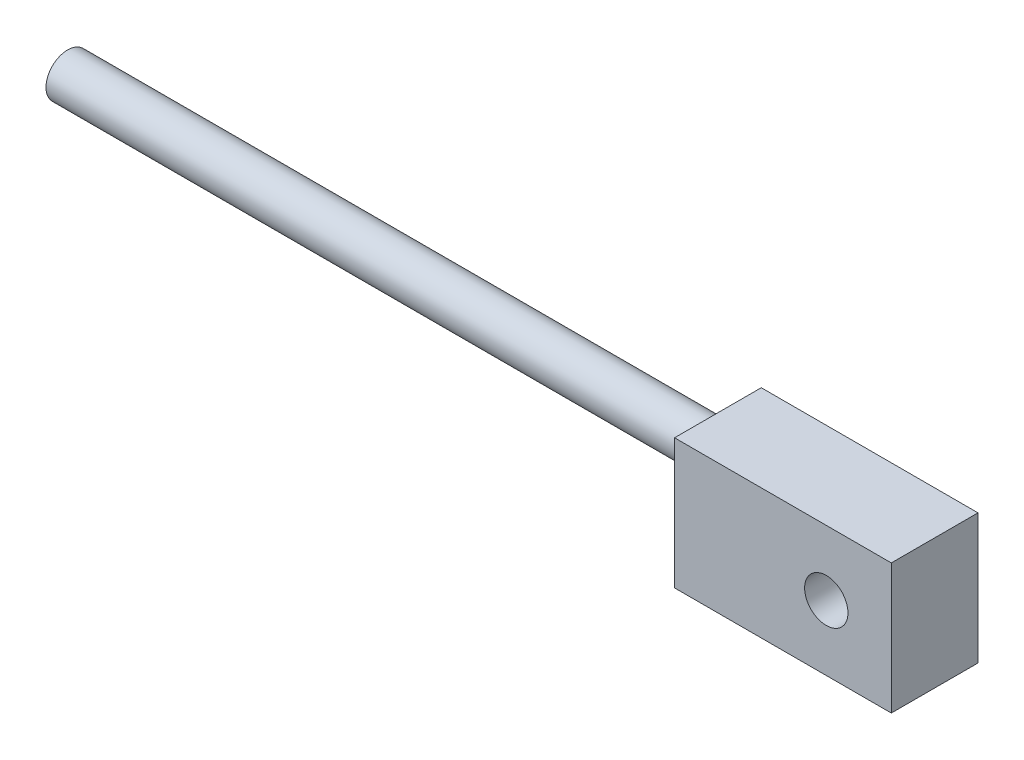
ISO-10303-21;
HEADER;
FILE_DESCRIPTION(('STEP AP214'),'2;1');
FILE_NAME('part.step','',(''),(''),'','','');
FILE_SCHEMA(('AUTOMOTIVE_DESIGN { 1 0 10303 214 1 1 1 1 }'));
ENDSEC;
DATA;
#1=APPLICATION_CONTEXT('core data for automotive mechanical design processes');
#2=APPLICATION_PROTOCOL_DEFINITION('international standard','automotive_design',2000,#1);
#3=PRODUCT_CONTEXT('',#1,'mechanical');
#4=PRODUCT('Part','Part','',(#3));
#5=PRODUCT_RELATED_PRODUCT_CATEGORY('part','',(#4));
#6=PRODUCT_DEFINITION_FORMATION('','',#4);
#7=PRODUCT_DEFINITION_CONTEXT('part definition',#1,'design');
#8=PRODUCT_DEFINITION('design','',#6,#7);
#9=PRODUCT_DEFINITION_SHAPE('','',#8);
#10=(LENGTH_UNIT() NAMED_UNIT(*) SI_UNIT(.MILLI.,.METRE.));
#11=(NAMED_UNIT(*) PLANE_ANGLE_UNIT() SI_UNIT($,.RADIAN.));
#12=(NAMED_UNIT(*) SI_UNIT($,.STERADIAN.) SOLID_ANGLE_UNIT());
#13=UNCERTAINTY_MEASURE_WITH_UNIT(LENGTH_MEASURE(1.E-05),#10,'distance_accuracy_value','');
#14=(GEOMETRIC_REPRESENTATION_CONTEXT(3) GLOBAL_UNCERTAINTY_ASSIGNED_CONTEXT((#13)) GLOBAL_UNIT_ASSIGNED_CONTEXT((#10,
#11,#12)) REPRESENTATION_CONTEXT('',''));
#15=CARTESIAN_POINT('',(0.,0.,0.));
#16=DIRECTION('',(0.,0.,1.));
#17=DIRECTION('',(1.,0.,0.));
#18=AXIS2_PLACEMENT_3D('',#15,#16,#17);
#19=CARTESIAN_POINT('',(30.,30.,-20.));
#20=DIRECTION('',(1.,0.,0.));
#21=DIRECTION('',(0.,0.,-1.));
#22=AXIS2_PLACEMENT_3D('',#19,#20,#21);
#23=PLANE('',#22);
#24=DIRECTION('',(0.,0.,1.));
#25=VECTOR('',#24,1.);
#26=CARTESIAN_POINT('',(30.,30.,-20.));
#27=LINE('',#26,#25);
#28=CARTESIAN_POINT('',(30.,30.,-20.));
#29=VERTEX_POINT('',#28);
#30=CARTESIAN_POINT('',(30.,30.,20.));
#31=VERTEX_POINT('',#30);
#32=EDGE_CURVE('E38',#29,#31,#27,.T.);
#33=ORIENTED_EDGE('',*,*,#32,.T.);
#34=DIRECTION('',(0.,1.,0.));
#35=VECTOR('',#34,1.);
#36=CARTESIAN_POINT('',(30.,30.,20.));
#37=LINE('',#36,#35);
#38=CARTESIAN_POINT('',(30.,-30.,20.));
#39=VERTEX_POINT('',#38);
#40=EDGE_CURVE('E75',#39,#31,#37,.T.);
#41=ORIENTED_EDGE('',*,*,#40,.F.);
#42=DIRECTION('',(0.,0.,1.));
#43=VECTOR('',#42,1.);
#44=CARTESIAN_POINT('',(30.,-30.,-20.));
#45=LINE('',#44,#43);
#46=CARTESIAN_POINT('',(30.,-30.,-20.));
#47=VERTEX_POINT('',#46);
#48=EDGE_CURVE('E11',#47,#39,#45,.T.);
#49=ORIENTED_EDGE('',*,*,#48,.F.);
#50=DIRECTION('',(0.,1.,0.));
#51=VECTOR('',#50,1.);
#52=CARTESIAN_POINT('',(30.,30.,-20.));
#53=LINE('',#52,#51);
#54=EDGE_CURVE('E76',#47,#29,#53,.T.);
#55=ORIENTED_EDGE('',*,*,#54,.T.);
#56=EDGE_LOOP('',(#33,#41,#49,#55));
#57=FACE_BOUND('',#56,.T.);
#58=ADVANCED_FACE('F35',(#57),#23,.T.);
#59=CARTESIAN_POINT('',(30.,-30.,-20.));
#60=DIRECTION('',(0.,-1.,0.));
#61=DIRECTION('',(1.,0.,0.));
#62=AXIS2_PLACEMENT_3D('',#59,#60,#61);
#63=PLANE('',#62);
#64=ORIENTED_EDGE('',*,*,#48,.T.);
#65=DIRECTION('',(1.,0.,0.));
#66=VECTOR('',#65,1.);
#67=CARTESIAN_POINT('',(30.,-30.,20.));
#68=LINE('',#67,#66);
#69=CARTESIAN_POINT('',(-70.,-30.,20.));
#70=VERTEX_POINT('',#69);
#71=EDGE_CURVE('E93',#70,#39,#68,.T.);
#72=ORIENTED_EDGE('',*,*,#71,.F.);
#73=DIRECTION('',(0.,0.,1.));
#74=VECTOR('',#73,1.);
#75=CARTESIAN_POINT('',(-70.,-30.,-20.));
#76=LINE('',#75,#74);
#77=CARTESIAN_POINT('',(-70.,-30.,-20.));
#78=VERTEX_POINT('',#77);
#79=EDGE_CURVE('E43',#78,#70,#76,.T.);
#80=ORIENTED_EDGE('',*,*,#79,.F.);
#81=DIRECTION('',(1.,0.,0.));
#82=VECTOR('',#81,1.);
#83=CARTESIAN_POINT('',(30.,-30.,-20.));
#84=LINE('',#83,#82);
#85=EDGE_CURVE('E81',#78,#47,#84,.T.);
#86=ORIENTED_EDGE('',*,*,#85,.T.);
#87=EDGE_LOOP('',(#64,#72,#80,#86));
#88=FACE_BOUND('',#87,.T.);
#89=ADVANCED_FACE('F116',(#88),#63,.T.);
#90=CARTESIAN_POINT('',(-70.,30.,-20.));
#91=DIRECTION('',(-1.,0.,0.));
#92=DIRECTION('',(0.,0.,1.));
#93=AXIS2_PLACEMENT_3D('',#90,#91,#92);
#94=PLANE('',#93);
#95=CARTESIAN_POINT('',(-70.,15.,0.));
#96=DIRECTION('',(-1.,0.,0.));
#97=DIRECTION('',(0.,0.,1.));
#98=AXIS2_PLACEMENT_3D('',#95,#96,#97);
#99=CIRCLE('',#98,10.);
#100=CARTESIAN_POINT('',(-70.,15.,10.));
#101=VERTEX_POINT('',#100);
#102=EDGE_CURVE('E143',#101,#101,#99,.T.);
#103=ORIENTED_EDGE('',*,*,#102,.F.);
#104=EDGE_LOOP('',(#103));
#105=FACE_BOUND('',#104,.T.);
#106=ORIENTED_EDGE('',*,*,#79,.T.);
#107=DIRECTION('',(0.,-1.,0.));
#108=VECTOR('',#107,1.);
#109=CARTESIAN_POINT('',(-70.,30.,20.));
#110=LINE('',#109,#108);
#111=CARTESIAN_POINT('',(-70.,30.,20.));
#112=VERTEX_POINT('',#111);
#113=EDGE_CURVE('E88',#112,#70,#110,.T.);
#114=ORIENTED_EDGE('',*,*,#113,.F.);
#115=DIRECTION('',(0.,0.,1.));
#116=VECTOR('',#115,1.);
#117=CARTESIAN_POINT('',(-70.,30.,-20.));
#118=LINE('',#117,#116);
#119=CARTESIAN_POINT('',(-70.,30.,-20.));
#120=VERTEX_POINT('',#119);
#121=EDGE_CURVE('E80',#120,#112,#118,.T.);
#122=ORIENTED_EDGE('',*,*,#121,.F.);
#123=DIRECTION('',(0.,-1.,0.));
#124=VECTOR('',#123,1.);
#125=CARTESIAN_POINT('',(-70.,30.,-20.));
#126=LINE('',#125,#124);
#127=EDGE_CURVE('E109',#120,#78,#126,.T.);
#128=ORIENTED_EDGE('',*,*,#127,.T.);
#129=EDGE_LOOP('',(#106,#114,#122,#128));
#130=FACE_BOUND('',#129,.T.);
#131=ADVANCED_FACE('F113',(#105,#130),#94,.T.);
#132=CARTESIAN_POINT('',(30.,30.,-20.));
#133=DIRECTION('',(0.,1.,0.));
#134=DIRECTION('',(-1.,0.,0.));
#135=AXIS2_PLACEMENT_3D('',#132,#133,#134);
#136=PLANE('',#135);
#137=ORIENTED_EDGE('',*,*,#121,.T.);
#138=DIRECTION('',(-1.,0.,0.));
#139=VECTOR('',#138,1.);
#140=CARTESIAN_POINT('',(30.,30.,20.));
#141=LINE('',#140,#139);
#142=EDGE_CURVE('E83',#31,#112,#141,.T.);
#143=ORIENTED_EDGE('',*,*,#142,.F.);
#144=ORIENTED_EDGE('',*,*,#32,.F.);
#145=DIRECTION('',(-1.,0.,0.));
#146=VECTOR('',#145,1.);
#147=CARTESIAN_POINT('',(30.,30.,-20.));
#148=LINE('',#147,#146);
#149=EDGE_CURVE('E107',#29,#120,#148,.T.);
#150=ORIENTED_EDGE('',*,*,#149,.T.);
#151=EDGE_LOOP('',(#137,#143,#144,#150));
#152=FACE_BOUND('',#151,.T.);
#153=ADVANCED_FACE('F84',(#152),#136,.T.);
#154=CARTESIAN_POINT('',(0.,0.,-20.));
#155=DIRECTION('',(0.,0.,-1.));
#156=DIRECTION('',(-1.,0.,0.));
#157=AXIS2_PLACEMENT_3D('',#154,#155,#156);
#158=PLANE('',#157);
#159=CARTESIAN_POINT('',(0.,0.,-20.));
#160=DIRECTION('',(0.,0.,1.));
#161=DIRECTION('',(1.,0.,0.));
#162=AXIS2_PLACEMENT_3D('',#159,#160,#161);
#163=CIRCLE('',#162,10.);
#164=CARTESIAN_POINT('',(10.,0.,-20.));
#165=VERTEX_POINT('',#164);
#166=EDGE_CURVE('E103',#165,#165,#163,.T.);
#167=ORIENTED_EDGE('',*,*,#166,.T.);
#168=EDGE_LOOP('',(#167));
#169=FACE_BOUND('',#168,.T.);
#170=ORIENTED_EDGE('',*,*,#54,.F.);
#171=ORIENTED_EDGE('',*,*,#85,.F.);
#172=ORIENTED_EDGE('',*,*,#127,.F.);
#173=ORIENTED_EDGE('',*,*,#149,.F.);
#174=EDGE_LOOP('',(#170,#171,#172,#173));
#175=FACE_BOUND('',#174,.T.);
#176=ADVANCED_FACE('F118',(#169,#175),#158,.T.);
#177=CARTESIAN_POINT('',(0.,0.,-20.));
#178=DIRECTION('',(0.,0.,1.));
#179=DIRECTION('',(1.,0.,0.));
#180=AXIS2_PLACEMENT_3D('',#177,#178,#179);
#181=CYLINDRICAL_SURFACE('',#180,10.);
#182=ORIENTED_EDGE('',*,*,#166,.F.);
#183=EDGE_LOOP('',(#182));
#184=FACE_BOUND('',#183,.T.);
#185=CARTESIAN_POINT('',(0.,0.,20.));
#186=DIRECTION('',(0.,0.,1.));
#187=DIRECTION('',(1.,0.,0.));
#188=AXIS2_PLACEMENT_3D('',#185,#186,#187);
#189=CIRCLE('',#188,10.);
#190=CARTESIAN_POINT('',(10.,0.,20.));
#191=VERTEX_POINT('',#190);
#192=EDGE_CURVE('E94',#191,#191,#189,.T.);
#193=ORIENTED_EDGE('',*,*,#192,.T.);
#194=EDGE_LOOP('',(#193));
#195=FACE_BOUND('',#194,.T.);
#196=ADVANCED_FACE('F120',(#184,#195),#181,.F.);
#197=CARTESIAN_POINT('',(0.,0.,20.));
#198=DIRECTION('',(0.,0.,-1.));
#199=DIRECTION('',(-1.,0.,0.));
#200=AXIS2_PLACEMENT_3D('',#197,#198,#199);
#201=PLANE('',#200);
#202=ORIENTED_EDGE('',*,*,#40,.T.);
#203=ORIENTED_EDGE('',*,*,#142,.T.);
#204=ORIENTED_EDGE('',*,*,#113,.T.);
#205=ORIENTED_EDGE('',*,*,#71,.T.);
#206=EDGE_LOOP('',(#202,#203,#204,#205));
#207=FACE_BOUND('',#206,.T.);
#208=ORIENTED_EDGE('',*,*,#192,.F.);
#209=EDGE_LOOP('',(#208));
#210=FACE_BOUND('',#209,.T.);
#211=ADVANCED_FACE('F91',(#207,#210),#201,.F.);
#212=CARTESIAN_POINT('',(-370.,15.,0.));
#213=DIRECTION('',(1.,0.,0.));
#214=DIRECTION('',(0.,0.,-1.));
#215=AXIS2_PLACEMENT_3D('',#212,#213,#214);
#216=CYLINDRICAL_SURFACE('',#215,10.);
#217=CARTESIAN_POINT('',(-370.,15.,0.));
#218=DIRECTION('',(-1.,0.,0.));
#219=DIRECTION('',(0.,0.,1.));
#220=AXIS2_PLACEMENT_3D('',#217,#218,#219);
#221=CIRCLE('',#220,10.);
#222=CARTESIAN_POINT('',(-370.,15.,10.));
#223=VERTEX_POINT('',#222);
#224=EDGE_CURVE('E97',#223,#223,#221,.T.);
#225=ORIENTED_EDGE('',*,*,#224,.F.);
#226=EDGE_LOOP('',(#225));
#227=FACE_BOUND('',#226,.T.);
#228=ORIENTED_EDGE('',*,*,#102,.T.);
#229=EDGE_LOOP('',(#228));
#230=FACE_BOUND('',#229,.T.);
#231=ADVANCED_FACE('F151',(#227,#230),#216,.T.);
#232=CARTESIAN_POINT('',(-370.,15.,0.));
#233=DIRECTION('',(-1.,0.,0.));
#234=DIRECTION('',(0.,0.,1.));
#235=AXIS2_PLACEMENT_3D('',#232,#233,#234);
#236=PLANE('',#235);
#237=ORIENTED_EDGE('',*,*,#224,.T.);
#238=EDGE_LOOP('',(#237));
#239=FACE_BOUND('',#238,.T.);
#240=ADVANCED_FACE('F149',(#239),#236,.T.);
#241=CLOSED_SHELL('',(#58,#89,#131,#153,#176,#196,#211,#231,#240));
#242=MANIFOLD_SOLID_BREP('B2',#241);
#243=ADVANCED_BREP_SHAPE_REPRESENTATION('',(#18,#242),#14);
#244=SHAPE_DEFINITION_REPRESENTATION(#9,#243);
ENDSEC;
END-ISO-10303-21;
